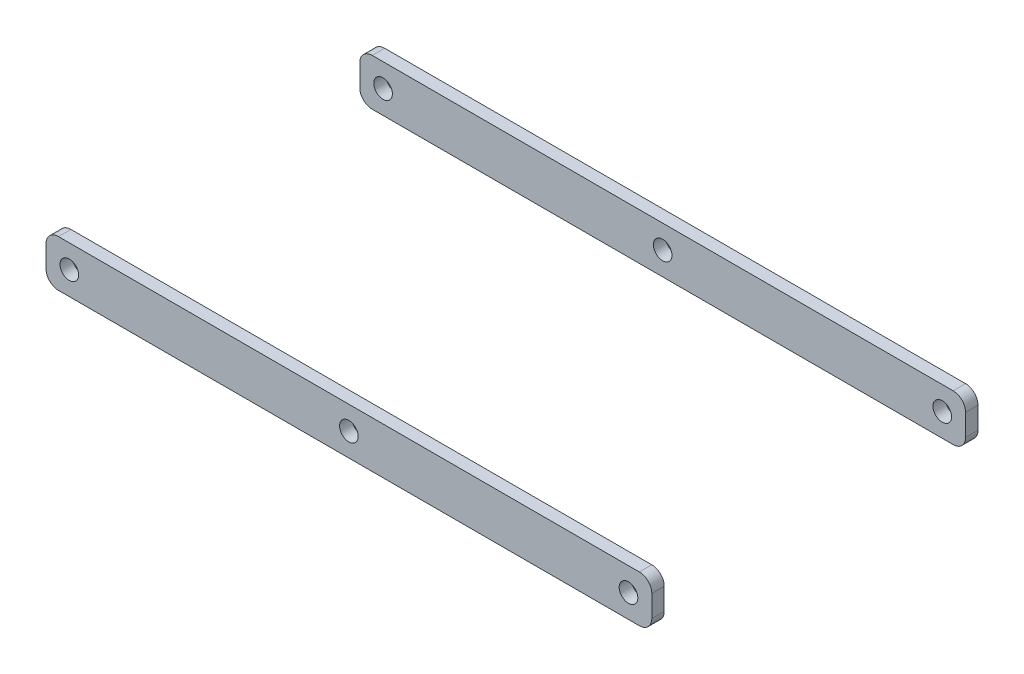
from build123d import *

# Parameters (mm, degrees)
SKETCH_1_W                           = 390
SKETCH_1_H                           = 30
ARMBLANK_390X30_DEPTH                = 105
SKETCH_2_W                           = 400
SKETCH_2_H                           = 40
SEPARATE_LEFT_RIGHT_8MM_ARMS_DEPTH   = 97
SKETCH_3_R                           = 6
THREE_PIVOT_HOLES_D12_PITCH180_DEPTH = 500
ARM_END_CORNER_R8_R                  = 8
ARM_END_CORNER_R8_BODY1_R            = 8


with BuildPart() as part:
    # Sketch 1 → ArmBlank_390x30 (new, symmetric)
    with BuildSketch(Plane.XY):
        Rectangle(SKETCH_1_W, SKETCH_1_H)
    extrude(amount=ARMBLANK_390X30_DEPTH, both=True)

    # Sketch 2 → Separate_Left_Right_8mm_Arms (cut, symmetric)
    with BuildSketch(Plane.XY):
        Rectangle(SKETCH_2_W, SKETCH_2_H)
    extrude(amount=SEPARATE_LEFT_RIGHT_8MM_ARMS_DEPTH, both=True, mode=Mode.SUBTRACT)


with BuildPart() as separate_left_right_8mm_arms_piece_1:
    # of the separate pieces the step leaves, piece 1, a body of its own (separate_left_right_8mm_arms_pieces)
    add(part.part.solids().sort_by_distance((-195, -15, -97))[0])


with BuildPart() as separate_left_right_8mm_arms_piece_2:
    # of the separate pieces the step leaves, piece 2, a body of its own (separate_left_right_8mm_arms_pieces)
    add(part.part.solids().sort_by_distance((-195, -15, 105))[0])


with BuildPart() as three_pivot_holes_d12_pitch180_tool:
    # Sketch 3 → Three_Pivot_Holes_D12_Pitch180 (new, symmetric)
    with BuildSketch(Plane.XY):
        with Locations(Location((-180, 0, 0), (0, 0, 180))):
            Circle(SKETCH_3_R)
        with Locations(Location((0, 0, 0), (0, 0, 180))):
            Circle(SKETCH_3_R)
        with Locations(Location((180, 0, 0), (0, 0, 180))):
            Circle(SKETCH_3_R)
    extrude(amount=THREE_PIVOT_HOLES_D12_PITCH180_DEPTH, both=True)


with BuildPart() as separate_left_right_8mm_arms_piece_1_1:
    add(separate_left_right_8mm_arms_piece_1.part)

    # Three_Pivot_Holes_D12_Pitch180: cut by three_pivot_holes_d12_pitch180_tool
    add(three_pivot_holes_d12_pitch180_tool.part, mode=Mode.SUBTRACT)

    # Arm_End_Corner_R8
    arm_end_corner_r8_edges = [separate_left_right_8mm_arms_piece_1_1.edges().sort_by_distance(p)[0] for p in [
        (195, 15, -101),
        (195, -15, -101),
        (-195, -15, -101),
        (-195, 15, -101),
    ]]
    fillet(arm_end_corner_r8_edges, radius=ARM_END_CORNER_R8_R)


with BuildPart() as separate_left_right_8mm_arms_piece_2_1:
    add(separate_left_right_8mm_arms_piece_2.part)

    # Three_Pivot_Holes_D12_Pitch180: cut by three_pivot_holes_d12_pitch180_tool
    add(three_pivot_holes_d12_pitch180_tool.part, mode=Mode.SUBTRACT)

    # Arm_End_Corner_R8_Body1
    arm_end_corner_r8_body1_edges = [separate_left_right_8mm_arms_piece_2_1.edges().sort_by_distance(p)[0] for p in [
        (195, 15, 101),
        (-195, 15, 101),
        (-195, -15, 101),
        (195, -15, 101),
    ]]
    fillet(arm_end_corner_r8_body1_edges, radius=ARM_END_CORNER_R8_BODY1_R)


solid = Compound([separate_left_right_8mm_arms_piece_1_1.part, separate_left_right_8mm_arms_piece_2_1.part])
